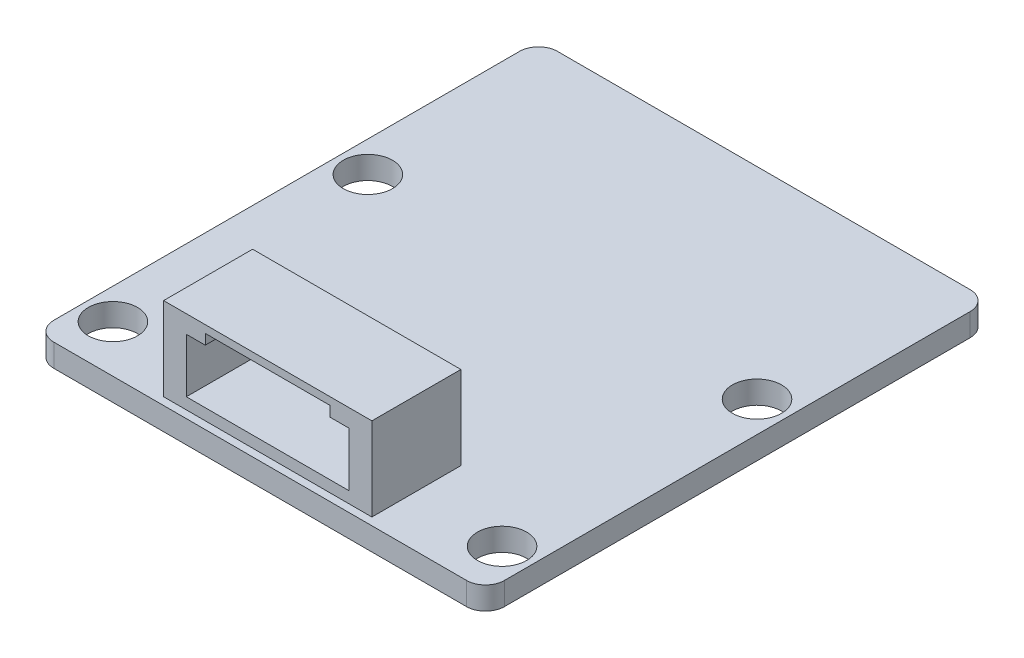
ISO-10303-21;
HEADER;
FILE_DESCRIPTION(('STEP AP214'),'2;1');
FILE_NAME('part.step','',(''),(''),'','','');
FILE_SCHEMA(('AUTOMOTIVE_DESIGN { 1 0 10303 214 1 1 1 1 }'));
ENDSEC;
DATA;
#1=APPLICATION_CONTEXT('core data for automotive mechanical design processes');
#2=APPLICATION_PROTOCOL_DEFINITION('international standard','automotive_design',2000,#1);
#3=PRODUCT_CONTEXT('',#1,'mechanical');
#4=PRODUCT('Part','Part','',(#3));
#5=PRODUCT_RELATED_PRODUCT_CATEGORY('part','',(#4));
#6=PRODUCT_DEFINITION_FORMATION('','',#4);
#7=PRODUCT_DEFINITION_CONTEXT('part definition',#1,'design');
#8=PRODUCT_DEFINITION('design','',#6,#7);
#9=PRODUCT_DEFINITION_SHAPE('','',#8);
#10=(LENGTH_UNIT() NAMED_UNIT(*) SI_UNIT(.MILLI.,.METRE.));
#11=(NAMED_UNIT(*) PLANE_ANGLE_UNIT() SI_UNIT($,.RADIAN.));
#12=(NAMED_UNIT(*) SI_UNIT($,.STERADIAN.) SOLID_ANGLE_UNIT());
#13=UNCERTAINTY_MEASURE_WITH_UNIT(LENGTH_MEASURE(1.E-05),#10,'distance_accuracy_value','');
#14=(GEOMETRIC_REPRESENTATION_CONTEXT(3) GLOBAL_UNCERTAINTY_ASSIGNED_CONTEXT((#13)) GLOBAL_UNIT_ASSIGNED_CONTEXT((#10,
#11,#12)) REPRESENTATION_CONTEXT('',''));
#15=CARTESIAN_POINT('',(0.,0.,0.));
#16=DIRECTION('',(0.,0.,1.));
#17=DIRECTION('',(1.,0.,0.));
#18=AXIS2_PLACEMENT_3D('',#15,#16,#17);
#19=CARTESIAN_POINT('',(0.,7.112,16.383));
#20=DIRECTION('',(0.,0.,-1.));
#21=DIRECTION('',(-1.,0.,0.));
#22=AXIS2_PLACEMENT_3D('',#19,#20,#21);
#23=PLANE('',#22);
#24=DIRECTION('',(1.,0.,0.));
#25=VECTOR('',#24,1.);
#26=CARTESIAN_POINT('',(0.,1.524,16.383));
#27=LINE('',#26,#25);
#28=CARTESIAN_POINT('',(-6.985,1.524,16.383));
#29=VERTEX_POINT('',#28);
#30=CARTESIAN_POINT('',(6.98500000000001,1.524,16.383));
#31=VERTEX_POINT('',#30);
#32=EDGE_CURVE('E267',#29,#31,#27,.T.);
#33=ORIENTED_EDGE('',*,*,#32,.T.);
#34=DIRECTION('',(0.,-1.,0.));
#35=VECTOR('',#34,1.);
#36=CARTESIAN_POINT('',(6.98500000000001,7.112,16.383));
#37=LINE('',#36,#35);
#38=CARTESIAN_POINT('',(6.98500000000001,7.112,16.383));
#39=VERTEX_POINT('',#38);
#40=EDGE_CURVE('E214',#39,#31,#37,.T.);
#41=ORIENTED_EDGE('',*,*,#40,.F.);
#42=DIRECTION('',(1.,0.,0.));
#43=VECTOR('',#42,1.);
#44=CARTESIAN_POINT('',(0.,7.112,16.383));
#45=LINE('',#44,#43);
#46=CARTESIAN_POINT('',(-6.985,7.112,16.383));
#47=VERTEX_POINT('',#46);
#48=EDGE_CURVE('E269',#47,#39,#45,.T.);
#49=ORIENTED_EDGE('',*,*,#48,.F.);
#50=DIRECTION('',(0.,-1.,0.));
#51=VECTOR('',#50,1.);
#52=CARTESIAN_POINT('',(-6.985,7.112,16.383));
#53=LINE('',#52,#51);
#54=EDGE_CURVE('E271',#47,#29,#53,.T.);
#55=ORIENTED_EDGE('',*,*,#54,.T.);
#56=EDGE_LOOP('',(#33,#41,#49,#55));
#57=FACE_BOUND('',#56,.T.);
#58=DIRECTION('',(-1.,0.,0.));
#59=VECTOR('',#58,1.);
#60=CARTESIAN_POINT('',(-4.191,6.604,16.383));
#61=LINE('',#60,#59);
#62=CARTESIAN_POINT('',(4.19100000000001,6.604,16.383));
#63=VERTEX_POINT('',#62);
#64=CARTESIAN_POINT('',(-4.191,6.604,16.383));
#65=VERTEX_POINT('',#64);
#66=EDGE_CURVE('E232',#63,#65,#61,.T.);
#67=ORIENTED_EDGE('',*,*,#66,.F.);
#68=DIRECTION('',(0.,-1.,0.));
#69=VECTOR('',#68,1.);
#70=CARTESIAN_POINT('',(4.19100000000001,5.9182,16.383));
#71=LINE('',#70,#69);
#72=CARTESIAN_POINT('',(4.19100000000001,5.9182,16.383));
#73=VERTEX_POINT('',#72);
#74=EDGE_CURVE('E192',#63,#73,#71,.T.);
#75=ORIENTED_EDGE('',*,*,#74,.T.);
#76=DIRECTION('',(1.,0.,0.));
#77=VECTOR('',#76,1.);
#78=CARTESIAN_POINT('',(4.19100000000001,5.9182,16.383));
#79=LINE('',#78,#77);
#80=CARTESIAN_POINT('',(5.46100000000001,5.9182,16.383));
#81=VERTEX_POINT('',#80);
#82=EDGE_CURVE('E593',#73,#81,#79,.T.);
#83=ORIENTED_EDGE('',*,*,#82,.T.);
#84=DIRECTION('',(0.,-1.,0.));
#85=VECTOR('',#84,1.);
#86=CARTESIAN_POINT('',(5.46100000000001,5.9182,16.383));
#87=LINE('',#86,#85);
#88=CARTESIAN_POINT('',(5.46100000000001,2.286,16.383));
#89=VERTEX_POINT('',#88);
#90=EDGE_CURVE('E596',#81,#89,#87,.T.);
#91=ORIENTED_EDGE('',*,*,#90,.T.);
#92=DIRECTION('',(1.,0.,0.));
#93=VECTOR('',#92,1.);
#94=CARTESIAN_POINT('',(0.,2.286,16.383));
#95=LINE('',#94,#93);
#96=CARTESIAN_POINT('',(-5.461,2.286,16.383));
#97=VERTEX_POINT('',#96);
#98=EDGE_CURVE('E196',#97,#89,#95,.T.);
#99=ORIENTED_EDGE('',*,*,#98,.F.);
#100=DIRECTION('',(0.,-1.,0.));
#101=VECTOR('',#100,1.);
#102=CARTESIAN_POINT('',(-5.461,5.9182,16.383));
#103=LINE('',#102,#101);
#104=CARTESIAN_POINT('',(-5.461,5.9182,16.383));
#105=VERTEX_POINT('',#104);
#106=EDGE_CURVE('E252',#105,#97,#103,.T.);
#107=ORIENTED_EDGE('',*,*,#106,.F.);
#108=DIRECTION('',(-1.,0.,0.));
#109=VECTOR('',#108,1.);
#110=CARTESIAN_POINT('',(-4.191,5.9182,16.383));
#111=LINE('',#110,#109);
#112=CARTESIAN_POINT('',(-4.191,5.9182,16.383));
#113=VERTEX_POINT('',#112);
#114=EDGE_CURVE('E249',#113,#105,#111,.T.);
#115=ORIENTED_EDGE('',*,*,#114,.F.);
#116=DIRECTION('',(0.,-1.,0.));
#117=VECTOR('',#116,1.);
#118=CARTESIAN_POINT('',(-4.191,5.9182,16.383));
#119=LINE('',#118,#117);
#120=EDGE_CURVE('E246',#65,#113,#119,.T.);
#121=ORIENTED_EDGE('',*,*,#120,.F.);
#122=EDGE_LOOP('',(#67,#75,#83,#91,#99,#107,#115,#121));
#123=FACE_BOUND('',#122,.T.);
#124=ADVANCED_FACE('F32',(#57,#123),#23,.F.);
#125=CARTESIAN_POINT('',(-15.113,1.524,-16.891));
#126=DIRECTION('',(0.,0.,1.));
#127=DIRECTION('',(1.,0.,0.));
#128=AXIS2_PLACEMENT_3D('',#125,#126,#127);
#129=PLANE('',#128);
#130=DIRECTION('',(-1.,0.,0.));
#131=VECTOR('',#130,1.);
#132=CARTESIAN_POINT('',(-15.113,1.524,-16.891));
#133=LINE('',#132,#131);
#134=CARTESIAN_POINT('',(13.843,1.524,-16.891));
#135=VERTEX_POINT('',#134);
#136=CARTESIAN_POINT('',(-13.843,1.524,-16.891));
#137=VERTEX_POINT('',#136);
#138=EDGE_CURVE('E296',#135,#137,#133,.T.);
#139=ORIENTED_EDGE('',*,*,#138,.F.);
#140=DIRECTION('',(0.,-1.,0.));
#141=VECTOR('',#140,1.);
#142=CARTESIAN_POINT('',(13.843,0.,-16.891));
#143=LINE('',#142,#141);
#144=CARTESIAN_POINT('',(13.843,0.,-16.891));
#145=VERTEX_POINT('',#144);
#146=EDGE_CURVE('E329',#135,#145,#143,.T.);
#147=ORIENTED_EDGE('',*,*,#146,.T.);
#148=DIRECTION('',(-1.,0.,0.));
#149=VECTOR('',#148,1.);
#150=CARTESIAN_POINT('',(-15.113,0.,-16.891));
#151=LINE('',#150,#149);
#152=CARTESIAN_POINT('',(-13.843,0.,-16.891));
#153=VERTEX_POINT('',#152);
#154=EDGE_CURVE('E287',#145,#153,#151,.T.);
#155=ORIENTED_EDGE('',*,*,#154,.T.);
#156=DIRECTION('',(0.,-1.,0.));
#157=VECTOR('',#156,1.);
#158=CARTESIAN_POINT('',(-13.843,1.524,-16.891));
#159=LINE('',#158,#157);
#160=EDGE_CURVE('E319',#153,#137,#159,.F.);
#161=ORIENTED_EDGE('',*,*,#160,.T.);
#162=EDGE_LOOP('',(#139,#147,#155,#161));
#163=FACE_BOUND('',#162,.T.);
#164=ADVANCED_FACE('F349',(#163),#129,.F.);
#165=CARTESIAN_POINT('',(-15.113,1.524,-16.891));
#166=DIRECTION('',(1.,0.,0.));
#167=DIRECTION('',(0.,0.,-1.));
#168=AXIS2_PLACEMENT_3D('',#165,#166,#167);
#169=PLANE('',#168);
#170=DIRECTION('',(0.,0.,1.));
#171=VECTOR('',#170,1.);
#172=CARTESIAN_POINT('',(-15.113,1.524,-16.891));
#173=LINE('',#172,#171);
#174=CARTESIAN_POINT('',(-15.113,1.524,-15.621));
#175=VERTEX_POINT('',#174);
#176=CARTESIAN_POINT('',(-15.113,1.524,15.621));
#177=VERTEX_POINT('',#176);
#178=EDGE_CURVE('E298',#175,#177,#173,.T.);
#179=ORIENTED_EDGE('',*,*,#178,.F.);
#180=DIRECTION('',(0.,-1.,0.));
#181=VECTOR('',#180,1.);
#182=CARTESIAN_POINT('',(-15.113,1.524,-15.621));
#183=LINE('',#182,#181);
#184=CARTESIAN_POINT('',(-15.113,0.,-15.621));
#185=VERTEX_POINT('',#184);
#186=EDGE_CURVE('E311',#175,#185,#183,.T.);
#187=ORIENTED_EDGE('',*,*,#186,.T.);
#188=DIRECTION('',(0.,0.,1.));
#189=VECTOR('',#188,1.);
#190=CARTESIAN_POINT('',(-15.113,0.,-16.891));
#191=LINE('',#190,#189);
#192=CARTESIAN_POINT('',(-15.113,0.,15.621));
#193=VERTEX_POINT('',#192);
#194=EDGE_CURVE('E306',#185,#193,#191,.T.);
#195=ORIENTED_EDGE('',*,*,#194,.T.);
#196=DIRECTION('',(0.,-1.,0.));
#197=VECTOR('',#196,1.);
#198=CARTESIAN_POINT('',(-15.113,1.524,15.621));
#199=LINE('',#198,#197);
#200=EDGE_CURVE('E304',#193,#177,#199,.F.);
#201=ORIENTED_EDGE('',*,*,#200,.T.);
#202=EDGE_LOOP('',(#179,#187,#195,#201));
#203=FACE_BOUND('',#202,.T.);
#204=ADVANCED_FACE('F371',(#203),#169,.F.);
#205=CARTESIAN_POINT('',(-15.113,1.524,16.891));
#206=DIRECTION('',(0.,0.,-1.));
#207=DIRECTION('',(-1.,0.,0.));
#208=AXIS2_PLACEMENT_3D('',#205,#206,#207);
#209=PLANE('',#208);
#210=DIRECTION('',(1.,0.,0.));
#211=VECTOR('',#210,1.);
#212=CARTESIAN_POINT('',(-15.113,0.,16.891));
#213=LINE('',#212,#211);
#214=CARTESIAN_POINT('',(-13.843,0.,16.891));
#215=VERTEX_POINT('',#214);
#216=CARTESIAN_POINT('',(13.843,0.,16.891));
#217=VERTEX_POINT('',#216);
#218=EDGE_CURVE('E299',#215,#217,#213,.T.);
#219=ORIENTED_EDGE('',*,*,#218,.T.);
#220=DIRECTION('',(0.,-1.,0.));
#221=VECTOR('',#220,1.);
#222=CARTESIAN_POINT('',(13.843,1.524,16.891));
#223=LINE('',#222,#221);
#224=CARTESIAN_POINT('',(13.843,1.524,16.891));
#225=VERTEX_POINT('',#224);
#226=EDGE_CURVE('E11',#217,#225,#223,.F.);
#227=ORIENTED_EDGE('',*,*,#226,.T.);
#228=DIRECTION('',(1.,0.,0.));
#229=VECTOR('',#228,1.);
#230=CARTESIAN_POINT('',(-15.113,1.524,16.891));
#231=LINE('',#230,#229);
#232=CARTESIAN_POINT('',(-13.843,1.524,16.891));
#233=VERTEX_POINT('',#232);
#234=EDGE_CURVE('E302',#233,#225,#231,.T.);
#235=ORIENTED_EDGE('',*,*,#234,.F.);
#236=DIRECTION('',(0.,-1.,0.));
#237=VECTOR('',#236,1.);
#238=CARTESIAN_POINT('',(-13.843,1.524,16.891));
#239=LINE('',#238,#237);
#240=EDGE_CURVE('E326',#233,#215,#239,.T.);
#241=ORIENTED_EDGE('',*,*,#240,.T.);
#242=EDGE_LOOP('',(#219,#227,#235,#241));
#243=FACE_BOUND('',#242,.T.);
#244=ADVANCED_FACE('F362',(#243),#209,.F.);
#245=CARTESIAN_POINT('',(0.,1.524,0.));
#246=DIRECTION('',(0.,1.,0.));
#247=DIRECTION('',(0.,0.,1.));
#248=AXIS2_PLACEMENT_3D('',#245,#246,#247);
#249=PLANE('',#248);
#250=DIRECTION('',(0.,0.,1.));
#251=VECTOR('',#250,1.);
#252=CARTESIAN_POINT('',(6.985,1.524,10.414));
#253=LINE('',#252,#251);
#254=CARTESIAN_POINT('',(6.985,1.524,10.414));
#255=VERTEX_POINT('',#254);
#256=EDGE_CURVE('E208',#255,#31,#253,.T.);
#257=ORIENTED_EDGE('',*,*,#256,.T.);
#258=ORIENTED_EDGE('',*,*,#32,.F.);
#259=DIRECTION('',(0.,0.,1.));
#260=VECTOR('',#259,1.);
#261=CARTESIAN_POINT('',(-6.985,1.524,10.414));
#262=LINE('',#261,#260);
#263=CARTESIAN_POINT('',(-6.985,1.524,10.414));
#264=VERTEX_POINT('',#263);
#265=EDGE_CURVE('E274',#264,#29,#262,.T.);
#266=ORIENTED_EDGE('',*,*,#265,.F.);
#267=DIRECTION('',(-1.,0.,0.));
#268=VECTOR('',#267,1.);
#269=CARTESIAN_POINT('',(0.,1.524,10.414));
#270=LINE('',#269,#268);
#271=EDGE_CURVE('E258',#255,#264,#270,.T.);
#272=ORIENTED_EDGE('',*,*,#271,.F.);
#273=EDGE_LOOP('',(#257,#258,#266,#272));
#274=FACE_BOUND('',#273,.T.);
#275=CARTESIAN_POINT('',(13.05052,1.524,13.716));
#276=DIRECTION('',(0.,-1.,0.));
#277=DIRECTION('',(0.,0.,1.));
#278=AXIS2_PLACEMENT_3D('',#275,#276,#277);
#279=CIRCLE('',#278,1.651);
#280=CARTESIAN_POINT('',(13.05052,1.524,15.367));
#281=VERTEX_POINT('',#280);
#282=EDGE_CURVE('E222',#281,#281,#279,.T.);
#283=ORIENTED_EDGE('',*,*,#282,.T.);
#284=EDGE_LOOP('',(#283));
#285=FACE_BOUND('',#284,.T.);
#286=CARTESIAN_POINT('',(13.05052,1.524,-3.38328000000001));
#287=DIRECTION('',(0.,-1.,0.));
#288=DIRECTION('',(0.,0.,1.));
#289=AXIS2_PLACEMENT_3D('',#286,#287,#288);
#290=CIRCLE('',#289,1.651);
#291=CARTESIAN_POINT('',(13.05052,1.524,-1.73228000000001));
#292=VERTEX_POINT('',#291);
#293=EDGE_CURVE('E217',#292,#292,#290,.T.);
#294=ORIENTED_EDGE('',*,*,#293,.T.);
#295=EDGE_LOOP('',(#294));
#296=FACE_BOUND('',#295,.T.);
#297=DIRECTION('',(0.,0.,1.));
#298=VECTOR('',#297,1.);
#299=CARTESIAN_POINT('',(15.113,1.524,-16.891));
#300=LINE('',#299,#298);
#301=CARTESIAN_POINT('',(15.113,1.524,-15.621));
#302=VERTEX_POINT('',#301);
#303=CARTESIAN_POINT('',(15.113,1.524,15.621));
#304=VERTEX_POINT('',#303);
#305=EDGE_CURVE('E230',#302,#304,#300,.T.);
#306=ORIENTED_EDGE('',*,*,#305,.F.);
#307=CARTESIAN_POINT('',(13.843,1.524,-15.621));
#308=DIRECTION('',(0.,1.,0.));
#309=DIRECTION('',(0.,0.,1.));
#310=AXIS2_PLACEMENT_3D('',#307,#308,#309);
#311=CIRCLE('',#310,1.27);
#312=EDGE_CURVE('E40',#302,#135,#311,.T.);
#313=ORIENTED_EDGE('',*,*,#312,.T.);
#314=ORIENTED_EDGE('',*,*,#138,.T.);
#315=CARTESIAN_POINT('',(-13.843,1.524,-15.621));
#316=DIRECTION('',(0.,1.,0.));
#317=DIRECTION('',(0.,0.,1.));
#318=AXIS2_PLACEMENT_3D('',#315,#316,#317);
#319=CIRCLE('',#318,1.27);
#320=EDGE_CURVE('E324',#137,#175,#319,.T.);
#321=ORIENTED_EDGE('',*,*,#320,.T.);
#322=ORIENTED_EDGE('',*,*,#178,.T.);
#323=CARTESIAN_POINT('',(-13.843,1.524,15.621));
#324=DIRECTION('',(0.,1.,0.));
#325=DIRECTION('',(0.,0.,1.));
#326=AXIS2_PLACEMENT_3D('',#323,#324,#325);
#327=CIRCLE('',#326,1.27);
#328=EDGE_CURVE('E322',#177,#233,#327,.T.);
#329=ORIENTED_EDGE('',*,*,#328,.T.);
#330=ORIENTED_EDGE('',*,*,#234,.T.);
#331=CARTESIAN_POINT('',(13.843,1.524,15.621));
#332=DIRECTION('',(0.,1.,0.));
#333=DIRECTION('',(0.,0.,1.));
#334=AXIS2_PLACEMENT_3D('',#331,#332,#333);
#335=CIRCLE('',#334,1.27);
#336=EDGE_CURVE('E52',#225,#304,#335,.T.);
#337=ORIENTED_EDGE('',*,*,#336,.T.);
#338=EDGE_LOOP('',(#306,#313,#314,#321,#322,#329,#330,#337));
#339=FACE_BOUND('',#338,.T.);
#340=CARTESIAN_POINT('',(-13.05052,1.524,13.716));
#341=DIRECTION('',(0.,1.,0.));
#342=DIRECTION('',(0.,0.,1.));
#343=AXIS2_PLACEMENT_3D('',#340,#341,#342);
#344=CIRCLE('',#343,1.651);
#345=CARTESIAN_POINT('',(-13.05052,1.524,15.367));
#346=VERTEX_POINT('',#345);
#347=EDGE_CURVE('E288',#346,#346,#344,.T.);
#348=ORIENTED_EDGE('',*,*,#347,.F.);
#349=EDGE_LOOP('',(#348));
#350=FACE_BOUND('',#349,.T.);
#351=CARTESIAN_POINT('',(-13.05052,1.524,-3.38328));
#352=DIRECTION('',(0.,1.,0.));
#353=DIRECTION('',(0.,0.,1.));
#354=AXIS2_PLACEMENT_3D('',#351,#352,#353);
#355=CIRCLE('',#354,1.651);
#356=CARTESIAN_POINT('',(-13.05052,1.524,-1.73228));
#357=VERTEX_POINT('',#356);
#358=EDGE_CURVE('E283',#357,#357,#355,.T.);
#359=ORIENTED_EDGE('',*,*,#358,.F.);
#360=EDGE_LOOP('',(#359));
#361=FACE_BOUND('',#360,.T.);
#362=ADVANCED_FACE('F343',(#274,#285,#296,#339,#350,#361),#249,.T.);
#363=CARTESIAN_POINT('',(0.,0.,0.));
#364=DIRECTION('',(0.,1.,0.));
#365=DIRECTION('',(0.,0.,1.));
#366=AXIS2_PLACEMENT_3D('',#363,#364,#365);
#367=PLANE('',#366);
#368=CARTESIAN_POINT('',(13.05052,0.,13.716));
#369=DIRECTION('',(0.,-1.,0.));
#370=DIRECTION('',(0.,0.,1.));
#371=AXIS2_PLACEMENT_3D('',#368,#369,#370);
#372=CIRCLE('',#371,1.651);
#373=CARTESIAN_POINT('',(13.05052,0.,15.367));
#374=VERTEX_POINT('',#373);
#375=EDGE_CURVE('E218',#374,#374,#372,.T.);
#376=ORIENTED_EDGE('',*,*,#375,.F.);
#377=EDGE_LOOP('',(#376));
#378=FACE_BOUND('',#377,.T.);
#379=CARTESIAN_POINT('',(13.05052,0.,-3.38328000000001));
#380=DIRECTION('',(0.,-1.,0.));
#381=DIRECTION('',(0.,0.,1.));
#382=AXIS2_PLACEMENT_3D('',#379,#380,#381);
#383=CIRCLE('',#382,1.651);
#384=CARTESIAN_POINT('',(13.05052,0.,-1.73228000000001));
#385=VERTEX_POINT('',#384);
#386=EDGE_CURVE('E225',#385,#385,#383,.T.);
#387=ORIENTED_EDGE('',*,*,#386,.F.);
#388=EDGE_LOOP('',(#387));
#389=FACE_BOUND('',#388,.T.);
#390=CARTESIAN_POINT('',(-13.05052,0.,13.716));
#391=DIRECTION('',(0.,1.,0.));
#392=DIRECTION('',(0.,0.,1.));
#393=AXIS2_PLACEMENT_3D('',#390,#391,#392);
#394=CIRCLE('',#393,1.651);
#395=CARTESIAN_POINT('',(-13.05052,0.,15.367));
#396=VERTEX_POINT('',#395);
#397=EDGE_CURVE('E284',#396,#396,#394,.T.);
#398=ORIENTED_EDGE('',*,*,#397,.T.);
#399=EDGE_LOOP('',(#398));
#400=FACE_BOUND('',#399,.T.);
#401=CARTESIAN_POINT('',(-13.05052,0.,-3.38328));
#402=DIRECTION('',(0.,1.,0.));
#403=DIRECTION('',(0.,0.,1.));
#404=AXIS2_PLACEMENT_3D('',#401,#402,#403);
#405=CIRCLE('',#404,1.651);
#406=CARTESIAN_POINT('',(-13.05052,0.,-1.73228));
#407=VERTEX_POINT('',#406);
#408=EDGE_CURVE('E291',#407,#407,#405,.T.);
#409=ORIENTED_EDGE('',*,*,#408,.T.);
#410=EDGE_LOOP('',(#409));
#411=FACE_BOUND('',#410,.T.);
#412=ORIENTED_EDGE('',*,*,#154,.F.);
#413=CARTESIAN_POINT('',(13.843,0.,-15.621));
#414=DIRECTION('',(0.,1.,0.));
#415=DIRECTION('',(0.,0.,1.));
#416=AXIS2_PLACEMENT_3D('',#413,#414,#415);
#417=CIRCLE('',#416,1.27);
#418=CARTESIAN_POINT('',(15.113,0.,-15.621));
#419=VERTEX_POINT('',#418);
#420=EDGE_CURVE('E334',#145,#419,#417,.F.);
#421=ORIENTED_EDGE('',*,*,#420,.T.);
#422=DIRECTION('',(0.,0.,1.));
#423=VECTOR('',#422,1.);
#424=CARTESIAN_POINT('',(15.113,0.,-16.891));
#425=LINE('',#424,#423);
#426=CARTESIAN_POINT('',(15.113,0.,15.621));
#427=VERTEX_POINT('',#426);
#428=EDGE_CURVE('E221',#419,#427,#425,.T.);
#429=ORIENTED_EDGE('',*,*,#428,.T.);
#430=CARTESIAN_POINT('',(13.843,0.,15.621));
#431=DIRECTION('',(0.,1.,0.));
#432=DIRECTION('',(0.,0.,1.));
#433=AXIS2_PLACEMENT_3D('',#430,#431,#432);
#434=CIRCLE('',#433,1.27);
#435=EDGE_CURVE('E332',#427,#217,#434,.F.);
#436=ORIENTED_EDGE('',*,*,#435,.T.);
#437=ORIENTED_EDGE('',*,*,#218,.F.);
#438=CARTESIAN_POINT('',(-13.843,0.,15.621));
#439=DIRECTION('',(0.,1.,0.));
#440=DIRECTION('',(0.,0.,1.));
#441=AXIS2_PLACEMENT_3D('',#438,#439,#440);
#442=CIRCLE('',#441,1.27);
#443=EDGE_CURVE('E314',#215,#193,#442,.F.);
#444=ORIENTED_EDGE('',*,*,#443,.T.);
#445=ORIENTED_EDGE('',*,*,#194,.F.);
#446=CARTESIAN_POINT('',(-13.843,0.,-15.621));
#447=DIRECTION('',(0.,1.,0.));
#448=DIRECTION('',(0.,0.,1.));
#449=AXIS2_PLACEMENT_3D('',#446,#447,#448);
#450=CIRCLE('',#449,1.27);
#451=EDGE_CURVE('E316',#185,#153,#450,.F.);
#452=ORIENTED_EDGE('',*,*,#451,.T.);
#453=EDGE_LOOP('',(#412,#421,#429,#436,#437,#444,#445,#452));
#454=FACE_BOUND('',#453,.T.);
#455=ADVANCED_FACE('F356',(#378,#389,#400,#411,#454),#367,.F.);
#456=CARTESIAN_POINT('',(-13.843,1.524,-15.621));
#457=DIRECTION('',(0.,-1.,0.));
#458=DIRECTION('',(0.,0.,-1.));
#459=AXIS2_PLACEMENT_3D('',#456,#457,#458);
#460=CYLINDRICAL_SURFACE('',#459,1.27);
#461=ORIENTED_EDGE('',*,*,#320,.F.);
#462=ORIENTED_EDGE('',*,*,#160,.F.);
#463=ORIENTED_EDGE('',*,*,#451,.F.);
#464=ORIENTED_EDGE('',*,*,#186,.F.);
#465=EDGE_LOOP('',(#461,#462,#463,#464));
#466=FACE_BOUND('',#465,.T.);
#467=ADVANCED_FACE('F374',(#466),#460,.T.);
#468=CARTESIAN_POINT('',(-13.843,1.524,15.621));
#469=DIRECTION('',(0.,-1.,0.));
#470=DIRECTION('',(0.,0.,-1.));
#471=AXIS2_PLACEMENT_3D('',#468,#469,#470);
#472=CYLINDRICAL_SURFACE('',#471,1.27);
#473=ORIENTED_EDGE('',*,*,#328,.F.);
#474=ORIENTED_EDGE('',*,*,#200,.F.);
#475=ORIENTED_EDGE('',*,*,#443,.F.);
#476=ORIENTED_EDGE('',*,*,#240,.F.);
#477=EDGE_LOOP('',(#473,#474,#475,#476));
#478=FACE_BOUND('',#477,.T.);
#479=ADVANCED_FACE('F366',(#478),#472,.T.);
#480=CARTESIAN_POINT('',(-13.05052,0.,-3.38328));
#481=DIRECTION('',(0.,1.,0.));
#482=DIRECTION('',(0.,0.,1.));
#483=AXIS2_PLACEMENT_3D('',#480,#481,#482);
#484=CYLINDRICAL_SURFACE('',#483,1.651);
#485=CARTESIAN_POINT('',(-13.05052,0.,-1.73228));
#486=CARTESIAN_POINT('',(-13.05052,0.015875,-1.73228));
#487=CARTESIAN_POINT('',(-13.05052,0.03175,-1.73228));
#488=CARTESIAN_POINT('',(-13.05052,0.0635,-1.73228));
#489=CARTESIAN_POINT('',(-13.05052,0.079375,-1.73228));
#490=CARTESIAN_POINT('',(-13.05052,0.111125,-1.73228));
#491=CARTESIAN_POINT('',(-13.05052,0.127,-1.73228));
#492=CARTESIAN_POINT('',(-13.05052,0.15875,-1.73228));
#493=CARTESIAN_POINT('',(-13.05052,0.174625,-1.73228));
#494=CARTESIAN_POINT('',(-13.05052,0.206375,-1.73228));
#495=CARTESIAN_POINT('',(-13.05052,0.22225,-1.73228));
#496=CARTESIAN_POINT('',(-13.05052,0.254,-1.73228));
#497=CARTESIAN_POINT('',(-13.05052,0.269875,-1.73228));
#498=CARTESIAN_POINT('',(-13.05052,0.301625,-1.73228));
#499=CARTESIAN_POINT('',(-13.05052,0.3175,-1.73228));
#500=CARTESIAN_POINT('',(-13.05052,0.34925,-1.73228));
#501=CARTESIAN_POINT('',(-13.05052,0.365125,-1.73228));
#502=CARTESIAN_POINT('',(-13.05052,0.396875,-1.73228));
#503=CARTESIAN_POINT('',(-13.05052,0.41275,-1.73228));
#504=CARTESIAN_POINT('',(-13.05052,0.4445,-1.73228));
#505=CARTESIAN_POINT('',(-13.05052,0.460375,-1.73228));
#506=CARTESIAN_POINT('',(-13.05052,0.492125,-1.73228));
#507=CARTESIAN_POINT('',(-13.05052,0.508,-1.73228));
#508=CARTESIAN_POINT('',(-13.05052,0.53975,-1.73228));
#509=CARTESIAN_POINT('',(-13.05052,0.555625,-1.73228));
#510=CARTESIAN_POINT('',(-13.05052,0.587375,-1.73228));
#511=CARTESIAN_POINT('',(-13.05052,0.60325,-1.73228));
#512=CARTESIAN_POINT('',(-13.05052,0.635,-1.73228));
#513=CARTESIAN_POINT('',(-13.05052,0.650875,-1.73228));
#514=CARTESIAN_POINT('',(-13.05052,0.682625,-1.73228));
#515=CARTESIAN_POINT('',(-13.05052,0.6985,-1.73228));
#516=CARTESIAN_POINT('',(-13.05052,0.73025,-1.73228));
#517=CARTESIAN_POINT('',(-13.05052,0.746125,-1.73228));
#518=CARTESIAN_POINT('',(-13.05052,0.777875,-1.73228));
#519=CARTESIAN_POINT('',(-13.05052,0.79375,-1.73228));
#520=CARTESIAN_POINT('',(-13.05052,0.8255,-1.73228));
#521=CARTESIAN_POINT('',(-13.05052,0.841375,-1.73228));
#522=CARTESIAN_POINT('',(-13.05052,0.873125,-1.73228));
#523=CARTESIAN_POINT('',(-13.05052,0.889,-1.73228));
#524=CARTESIAN_POINT('',(-13.05052,0.92075,-1.73228));
#525=CARTESIAN_POINT('',(-13.05052,0.936625,-1.73228));
#526=CARTESIAN_POINT('',(-13.05052,0.968375,-1.73228));
#527=CARTESIAN_POINT('',(-13.05052,0.98425,-1.73228));
#528=CARTESIAN_POINT('',(-13.05052,1.016,-1.73228));
#529=CARTESIAN_POINT('',(-13.05052,1.031875,-1.73228));
#530=CARTESIAN_POINT('',(-13.05052,1.063625,-1.73228));
#531=CARTESIAN_POINT('',(-13.05052,1.0795,-1.73228));
#532=CARTESIAN_POINT('',(-13.05052,1.11125,-1.73228));
#533=CARTESIAN_POINT('',(-13.05052,1.127125,-1.73228));
#534=CARTESIAN_POINT('',(-13.05052,1.158875,-1.73228));
#535=CARTESIAN_POINT('',(-13.05052,1.17475,-1.73228));
#536=CARTESIAN_POINT('',(-13.05052,1.2065,-1.73228));
#537=CARTESIAN_POINT('',(-13.05052,1.222375,-1.73228));
#538=CARTESIAN_POINT('',(-13.05052,1.254125,-1.73228));
#539=CARTESIAN_POINT('',(-13.05052,1.27,-1.73228));
#540=CARTESIAN_POINT('',(-13.05052,1.30175,-1.73228));
#541=CARTESIAN_POINT('',(-13.05052,1.317625,-1.73228));
#542=CARTESIAN_POINT('',(-13.05052,1.349375,-1.73228));
#543=CARTESIAN_POINT('',(-13.05052,1.36525,-1.73228));
#544=CARTESIAN_POINT('',(-13.05052,1.397,-1.73228));
#545=CARTESIAN_POINT('',(-13.05052,1.412875,-1.73228));
#546=CARTESIAN_POINT('',(-13.05052,1.444625,-1.73228));
#547=CARTESIAN_POINT('',(-13.05052,1.4605,-1.73228));
#548=CARTESIAN_POINT('',(-13.05052,1.49225,-1.73228));
#549=CARTESIAN_POINT('',(-13.05052,1.508125,-1.73228));
#550=CARTESIAN_POINT('',(-13.05052,1.524,-1.73228));
#551=B_SPLINE_CURVE_WITH_KNOTS('',3,(#485,#486,#487,#488,#489,#490,#491,#492,#493,#494,#495,
#496,#497,#498,#499,#500,#501,#502,#503,#504,#505,#506,#507,#508,#509,#510,#511,#512,#513,#514,
#515,#516,#517,#518,#519,#520,#521,#522,#523,#524,#525,#526,#527,#528,#529,#530,#531,#532,#533,
#534,#535,#536,#537,#538,#539,#540,#541,#542,#543,#544,#545,#546,#547,#548,#549,#550),
.UNSPECIFIED.,.F.,.F.,(4,2,2,2,2,2,2,2,2,2,2,2,2,2,2,2,2,2,2,2,2,2,2,2,2,2,2,2,2,2,2,2,4),(0.,
0.047625,0.09525,0.142875,0.1905,0.238125,0.28575,0.333375,0.381,0.428625,0.47625,0.523875,
0.5715,0.619125,0.66675,0.714375,0.762,0.809625,0.85725,0.904875,0.9525,1.000125,1.04775,
1.095375,1.143,1.190625,1.23825,1.285875,1.3335,1.381125,1.42875,1.476375,1.524),.UNSPECIFIED.);
#552=EDGE_CURVE('BSEAM381',#407,#357,#551,.T.);
#553=ORIENTED_EDGE('',*,*,#408,.F.);
#554=ORIENTED_EDGE('',*,*,#358,.T.);
#555=ORIENTED_EDGE('',*,*,#552,.T.);
#556=ORIENTED_EDGE('',*,*,#552,.F.);
#557=EDGE_LOOP('',(#553,#555,#554,#556));
#558=FACE_BOUND('',#557,.T.);
#559=ADVANCED_FACE('F381',(#558),#484,.F.);
#560=CARTESIAN_POINT('',(-13.05052,0.,13.716));
#561=DIRECTION('',(0.,1.,0.));
#562=DIRECTION('',(0.,0.,1.));
#563=AXIS2_PLACEMENT_3D('',#560,#561,#562);
#564=CYLINDRICAL_SURFACE('',#563,1.651);
#565=CARTESIAN_POINT('',(-13.05052,0.,15.367));
#566=CARTESIAN_POINT('',(-13.05052,0.015875,15.367));
#567=CARTESIAN_POINT('',(-13.05052,0.03175,15.367));
#568=CARTESIAN_POINT('',(-13.05052,0.0635,15.367));
#569=CARTESIAN_POINT('',(-13.05052,0.079375,15.367));
#570=CARTESIAN_POINT('',(-13.05052,0.111125,15.367));
#571=CARTESIAN_POINT('',(-13.05052,0.127,15.367));
#572=CARTESIAN_POINT('',(-13.05052,0.15875,15.367));
#573=CARTESIAN_POINT('',(-13.05052,0.174625,15.367));
#574=CARTESIAN_POINT('',(-13.05052,0.206375,15.367));
#575=CARTESIAN_POINT('',(-13.05052,0.22225,15.367));
#576=CARTESIAN_POINT('',(-13.05052,0.254,15.367));
#577=CARTESIAN_POINT('',(-13.05052,0.269875,15.367));
#578=CARTESIAN_POINT('',(-13.05052,0.301625,15.367));
#579=CARTESIAN_POINT('',(-13.05052,0.3175,15.367));
#580=CARTESIAN_POINT('',(-13.05052,0.34925,15.367));
#581=CARTESIAN_POINT('',(-13.05052,0.365125,15.367));
#582=CARTESIAN_POINT('',(-13.05052,0.396875,15.367));
#583=CARTESIAN_POINT('',(-13.05052,0.41275,15.367));
#584=CARTESIAN_POINT('',(-13.05052,0.4445,15.367));
#585=CARTESIAN_POINT('',(-13.05052,0.460375,15.367));
#586=CARTESIAN_POINT('',(-13.05052,0.492125,15.367));
#587=CARTESIAN_POINT('',(-13.05052,0.508,15.367));
#588=CARTESIAN_POINT('',(-13.05052,0.53975,15.367));
#589=CARTESIAN_POINT('',(-13.05052,0.555625,15.367));
#590=CARTESIAN_POINT('',(-13.05052,0.587375,15.367));
#591=CARTESIAN_POINT('',(-13.05052,0.60325,15.367));
#592=CARTESIAN_POINT('',(-13.05052,0.635,15.367));
#593=CARTESIAN_POINT('',(-13.05052,0.650875,15.367));
#594=CARTESIAN_POINT('',(-13.05052,0.682625,15.367));
#595=CARTESIAN_POINT('',(-13.05052,0.6985,15.367));
#596=CARTESIAN_POINT('',(-13.05052,0.73025,15.367));
#597=CARTESIAN_POINT('',(-13.05052,0.746125,15.367));
#598=CARTESIAN_POINT('',(-13.05052,0.777875,15.367));
#599=CARTESIAN_POINT('',(-13.05052,0.79375,15.367));
#600=CARTESIAN_POINT('',(-13.05052,0.8255,15.367));
#601=CARTESIAN_POINT('',(-13.05052,0.841375,15.367));
#602=CARTESIAN_POINT('',(-13.05052,0.873125,15.367));
#603=CARTESIAN_POINT('',(-13.05052,0.889,15.367));
#604=CARTESIAN_POINT('',(-13.05052,0.92075,15.367));
#605=CARTESIAN_POINT('',(-13.05052,0.936625,15.367));
#606=CARTESIAN_POINT('',(-13.05052,0.968375,15.367));
#607=CARTESIAN_POINT('',(-13.05052,0.98425,15.367));
#608=CARTESIAN_POINT('',(-13.05052,1.016,15.367));
#609=CARTESIAN_POINT('',(-13.05052,1.031875,15.367));
#610=CARTESIAN_POINT('',(-13.05052,1.063625,15.367));
#611=CARTESIAN_POINT('',(-13.05052,1.0795,15.367));
#612=CARTESIAN_POINT('',(-13.05052,1.11125,15.367));
#613=CARTESIAN_POINT('',(-13.05052,1.127125,15.367));
#614=CARTESIAN_POINT('',(-13.05052,1.158875,15.367));
#615=CARTESIAN_POINT('',(-13.05052,1.17475,15.367));
#616=CARTESIAN_POINT('',(-13.05052,1.2065,15.367));
#617=CARTESIAN_POINT('',(-13.05052,1.222375,15.367));
#618=CARTESIAN_POINT('',(-13.05052,1.254125,15.367));
#619=CARTESIAN_POINT('',(-13.05052,1.27,15.367));
#620=CARTESIAN_POINT('',(-13.05052,1.30175,15.367));
#621=CARTESIAN_POINT('',(-13.05052,1.317625,15.367));
#622=CARTESIAN_POINT('',(-13.05052,1.349375,15.367));
#623=CARTESIAN_POINT('',(-13.05052,1.36525,15.367));
#624=CARTESIAN_POINT('',(-13.05052,1.397,15.367));
#625=CARTESIAN_POINT('',(-13.05052,1.412875,15.367));
#626=CARTESIAN_POINT('',(-13.05052,1.444625,15.367));
#627=CARTESIAN_POINT('',(-13.05052,1.4605,15.367));
#628=CARTESIAN_POINT('',(-13.05052,1.49225,15.367));
#629=CARTESIAN_POINT('',(-13.05052,1.508125,15.367));
#630=CARTESIAN_POINT('',(-13.05052,1.524,15.367));
#631=B_SPLINE_CURVE_WITH_KNOTS('',3,(#565,#566,#567,#568,#569,#570,#571,#572,#573,#574,#575,
#576,#577,#578,#579,#580,#581,#582,#583,#584,#585,#586,#587,#588,#589,#590,#591,#592,#593,#594,
#595,#596,#597,#598,#599,#600,#601,#602,#603,#604,#605,#606,#607,#608,#609,#610,#611,#612,#613,
#614,#615,#616,#617,#618,#619,#620,#621,#622,#623,#624,#625,#626,#627,#628,#629,#630),
.UNSPECIFIED.,.F.,.F.,(4,2,2,2,2,2,2,2,2,2,2,2,2,2,2,2,2,2,2,2,2,2,2,2,2,2,2,2,2,2,2,2,4),(0.,
0.047625,0.09525,0.142875,0.1905,0.238125,0.28575,0.333375,0.381,0.428625,0.47625,0.523875,
0.5715,0.619125,0.66675,0.714375,0.762,0.809625,0.85725,0.904875,0.9525,1.000125,1.04775,
1.095375,1.143,1.190625,1.23825,1.285875,1.3335,1.381125,1.42875,1.476375,1.524),.UNSPECIFIED.);
#632=EDGE_CURVE('BSEAM404',#396,#346,#631,.T.);
#633=ORIENTED_EDGE('',*,*,#397,.F.);
#634=ORIENTED_EDGE('',*,*,#347,.T.);
#635=ORIENTED_EDGE('',*,*,#632,.T.);
#636=ORIENTED_EDGE('',*,*,#632,.F.);
#637=EDGE_LOOP('',(#633,#635,#634,#636));
#638=FACE_BOUND('',#637,.T.);
#639=ADVANCED_FACE('F404',(#638),#564,.F.);
#640=CARTESIAN_POINT('',(0.,7.112,10.414));
#641=DIRECTION('',(0.,0.,1.));
#642=DIRECTION('',(1.,0.,0.));
#643=AXIS2_PLACEMENT_3D('',#640,#641,#642);
#644=PLANE('',#643);
#645=ORIENTED_EDGE('',*,*,#271,.T.);
#646=DIRECTION('',(0.,-1.,0.));
#647=VECTOR('',#646,1.);
#648=CARTESIAN_POINT('',(-6.985,7.112,10.414));
#649=LINE('',#648,#647);
#650=CARTESIAN_POINT('',(-6.985,7.112,10.414));
#651=VERTEX_POINT('',#650);
#652=EDGE_CURVE('E280',#651,#264,#649,.T.);
#653=ORIENTED_EDGE('',*,*,#652,.F.);
#654=DIRECTION('',(-1.,0.,0.));
#655=VECTOR('',#654,1.);
#656=CARTESIAN_POINT('',(0.,7.112,10.414));
#657=LINE('',#656,#655);
#658=CARTESIAN_POINT('',(6.985,7.112,10.414));
#659=VERTEX_POINT('',#658);
#660=EDGE_CURVE('E264',#659,#651,#657,.T.);
#661=ORIENTED_EDGE('',*,*,#660,.F.);
#662=DIRECTION('',(0.,-1.,0.));
#663=VECTOR('',#662,1.);
#664=CARTESIAN_POINT('',(6.985,7.112,10.414));
#665=LINE('',#664,#663);
#666=EDGE_CURVE('E207',#659,#255,#665,.T.);
#667=ORIENTED_EDGE('',*,*,#666,.T.);
#668=EDGE_LOOP('',(#645,#653,#661,#667));
#669=FACE_BOUND('',#668,.T.);
#670=ADVANCED_FACE('F400',(#669),#644,.F.);
#671=CARTESIAN_POINT('',(-6.985,7.112,10.414));
#672=DIRECTION('',(1.,0.,0.));
#673=DIRECTION('',(0.,0.,-1.));
#674=AXIS2_PLACEMENT_3D('',#671,#672,#673);
#675=PLANE('',#674);
#676=ORIENTED_EDGE('',*,*,#265,.T.);
#677=ORIENTED_EDGE('',*,*,#54,.F.);
#678=DIRECTION('',(0.,0.,1.));
#679=VECTOR('',#678,1.);
#680=CARTESIAN_POINT('',(-6.985,7.112,10.414));
#681=LINE('',#680,#679);
#682=EDGE_CURVE('E266',#651,#47,#681,.T.);
#683=ORIENTED_EDGE('',*,*,#682,.F.);
#684=ORIENTED_EDGE('',*,*,#652,.T.);
#685=EDGE_LOOP('',(#676,#677,#683,#684));
#686=FACE_BOUND('',#685,.T.);
#687=ADVANCED_FACE('F397',(#686),#675,.F.);
#688=CARTESIAN_POINT('',(0.,7.112,0.));
#689=DIRECTION('',(0.,-1.,0.));
#690=DIRECTION('',(0.,0.,-1.));
#691=AXIS2_PLACEMENT_3D('',#688,#689,#690);
#692=PLANE('',#691);
#693=ORIENTED_EDGE('',*,*,#48,.T.);
#694=DIRECTION('',(0.,0.,1.));
#695=VECTOR('',#694,1.);
#696=CARTESIAN_POINT('',(6.985,7.112,10.414));
#697=LINE('',#696,#695);
#698=EDGE_CURVE('E204',#659,#39,#697,.T.);
#699=ORIENTED_EDGE('',*,*,#698,.F.);
#700=ORIENTED_EDGE('',*,*,#660,.T.);
#701=ORIENTED_EDGE('',*,*,#682,.T.);
#702=EDGE_LOOP('',(#693,#699,#700,#701));
#703=FACE_BOUND('',#702,.T.);
#704=ADVANCED_FACE('F395',(#703),#692,.F.);
#705=CARTESIAN_POINT('',(0.,2.286,11.303));
#706=DIRECTION('',(0.,-1.,0.));
#707=DIRECTION('',(1.,0.,0.));
#708=AXIS2_PLACEMENT_3D('',#705,#706,#707);
#709=PLANE('',#708);
#710=ORIENTED_EDGE('',*,*,#98,.T.);
#711=DIRECTION('',(0.,0.,1.));
#712=VECTOR('',#711,1.);
#713=CARTESIAN_POINT('',(5.461,2.286,11.303));
#714=LINE('',#713,#712);
#715=CARTESIAN_POINT('',(5.461,2.286,11.303));
#716=VERTEX_POINT('',#715);
#717=EDGE_CURVE('E188',#716,#89,#714,.T.);
#718=ORIENTED_EDGE('',*,*,#717,.F.);
#719=DIRECTION('',(1.,0.,0.));
#720=VECTOR('',#719,1.);
#721=CARTESIAN_POINT('',(0.,2.286,11.303));
#722=LINE('',#721,#720);
#723=CARTESIAN_POINT('',(-5.461,2.286,11.303));
#724=VERTEX_POINT('',#723);
#725=EDGE_CURVE('E171',#724,#716,#722,.T.);
#726=ORIENTED_EDGE('',*,*,#725,.F.);
#727=DIRECTION('',(0.,0.,1.));
#728=VECTOR('',#727,1.);
#729=CARTESIAN_POINT('',(-5.461,2.286,11.303));
#730=LINE('',#729,#728);
#731=EDGE_CURVE('E256',#724,#97,#730,.T.);
#732=ORIENTED_EDGE('',*,*,#731,.T.);
#733=EDGE_LOOP('',(#710,#718,#726,#732));
#734=FACE_BOUND('',#733,.T.);
#735=ADVANCED_FACE('F194',(#734),#709,.F.);
#736=CARTESIAN_POINT('',(-5.461,5.9182,11.303));
#737=DIRECTION('',(-1.,0.,0.));
#738=DIRECTION('',(0.,-1.,0.));
#739=AXIS2_PLACEMENT_3D('',#736,#737,#738);
#740=PLANE('',#739);
#741=ORIENTED_EDGE('',*,*,#106,.T.);
#742=ORIENTED_EDGE('',*,*,#731,.F.);
#743=DIRECTION('',(0.,-1.,0.));
#744=VECTOR('',#743,1.);
#745=CARTESIAN_POINT('',(-5.461,5.9182,11.303));
#746=LINE('',#745,#744);
#747=CARTESIAN_POINT('',(-5.461,5.9182,11.303));
#748=VERTEX_POINT('',#747);
#749=EDGE_CURVE('E178',#748,#724,#746,.T.);
#750=ORIENTED_EDGE('',*,*,#749,.F.);
#751=DIRECTION('',(0.,0.,1.));
#752=VECTOR('',#751,1.);
#753=CARTESIAN_POINT('',(-5.461,5.9182,11.303));
#754=LINE('',#753,#752);
#755=EDGE_CURVE('E259',#748,#105,#754,.T.);
#756=ORIENTED_EDGE('',*,*,#755,.T.);
#757=EDGE_LOOP('',(#741,#742,#750,#756));
#758=FACE_BOUND('',#757,.T.);
#759=ADVANCED_FACE('F463',(#758),#740,.F.);
#760=CARTESIAN_POINT('',(-4.191,5.9182,11.303));
#761=DIRECTION('',(0.,1.,0.));
#762=DIRECTION('',(0.,0.,1.));
#763=AXIS2_PLACEMENT_3D('',#760,#761,#762);
#764=PLANE('',#763);
#765=ORIENTED_EDGE('',*,*,#114,.T.);
#766=ORIENTED_EDGE('',*,*,#755,.F.);
#767=DIRECTION('',(-1.,0.,0.));
#768=VECTOR('',#767,1.);
#769=CARTESIAN_POINT('',(-4.191,5.9182,11.303));
#770=LINE('',#769,#768);
#771=CARTESIAN_POINT('',(-4.191,5.9182,11.303));
#772=VERTEX_POINT('',#771);
#773=EDGE_CURVE('E241',#772,#748,#770,.T.);
#774=ORIENTED_EDGE('',*,*,#773,.F.);
#775=DIRECTION('',(0.,0.,1.));
#776=VECTOR('',#775,1.);
#777=CARTESIAN_POINT('',(-4.191,5.9182,11.303));
#778=LINE('',#777,#776);
#779=EDGE_CURVE('E261',#772,#113,#778,.T.);
#780=ORIENTED_EDGE('',*,*,#779,.T.);
#781=EDGE_LOOP('',(#765,#766,#774,#780));
#782=FACE_BOUND('',#781,.T.);
#783=ADVANCED_FACE('F571',(#782),#764,.F.);
#784=CARTESIAN_POINT('',(-4.191,5.9182,11.303));
#785=DIRECTION('',(-1.,0.,0.));
#786=DIRECTION('',(0.,0.,1.));
#787=AXIS2_PLACEMENT_3D('',#784,#785,#786);
#788=PLANE('',#787);
#789=ORIENTED_EDGE('',*,*,#120,.T.);
#790=ORIENTED_EDGE('',*,*,#779,.F.);
#791=DIRECTION('',(0.,-1.,0.));
#792=VECTOR('',#791,1.);
#793=CARTESIAN_POINT('',(-4.191,5.9182,11.303));
#794=LINE('',#793,#792);
#795=CARTESIAN_POINT('',(-4.191,6.604,11.303));
#796=VERTEX_POINT('',#795);
#797=EDGE_CURVE('E238',#796,#772,#794,.T.);
#798=ORIENTED_EDGE('',*,*,#797,.F.);
#799=DIRECTION('',(0.,0.,1.));
#800=VECTOR('',#799,1.);
#801=CARTESIAN_POINT('',(-4.191,6.604,11.303));
#802=LINE('',#801,#800);
#803=EDGE_CURVE('E181',#796,#65,#802,.T.);
#804=ORIENTED_EDGE('',*,*,#803,.T.);
#805=EDGE_LOOP('',(#789,#790,#798,#804));
#806=FACE_BOUND('',#805,.T.);
#807=ADVANCED_FACE('F476',(#806),#788,.F.);
#808=CARTESIAN_POINT('',(-4.191,6.604,11.303));
#809=DIRECTION('',(0.,1.,0.));
#810=DIRECTION('',(0.,0.,1.));
#811=AXIS2_PLACEMENT_3D('',#808,#809,#810);
#812=PLANE('',#811);
#813=ORIENTED_EDGE('',*,*,#66,.T.);
#814=ORIENTED_EDGE('',*,*,#803,.F.);
#815=DIRECTION('',(-1.,0.,0.));
#816=VECTOR('',#815,1.);
#817=CARTESIAN_POINT('',(-4.191,6.604,11.303));
#818=LINE('',#817,#816);
#819=CARTESIAN_POINT('',(4.191,6.604,11.303));
#820=VERTEX_POINT('',#819);
#821=EDGE_CURVE('E235',#820,#796,#818,.T.);
#822=ORIENTED_EDGE('',*,*,#821,.F.);
#823=DIRECTION('',(0.,0.,1.));
#824=VECTOR('',#823,1.);
#825=CARTESIAN_POINT('',(4.191,6.604,11.303));
#826=LINE('',#825,#824);
#827=EDGE_CURVE('E211',#820,#63,#826,.T.);
#828=ORIENTED_EDGE('',*,*,#827,.T.);
#829=EDGE_LOOP('',(#813,#814,#822,#828));
#830=FACE_BOUND('',#829,.T.);
#831=ADVANCED_FACE('F472',(#830),#812,.F.);
#832=CARTESIAN_POINT('',(0.,0.,11.303));
#833=DIRECTION('',(0.,0.,-1.));
#834=DIRECTION('',(-1.,0.,0.));
#835=AXIS2_PLACEMENT_3D('',#832,#833,#834);
#836=PLANE('',#835);
#837=ORIENTED_EDGE('',*,*,#725,.T.);
#838=DIRECTION('',(0.,-1.,0.));
#839=VECTOR('',#838,1.);
#840=CARTESIAN_POINT('',(5.461,5.9182,11.303));
#841=LINE('',#840,#839);
#842=CARTESIAN_POINT('',(5.461,5.9182,11.303));
#843=VERTEX_POINT('',#842);
#844=EDGE_CURVE('E175',#843,#716,#841,.T.);
#845=ORIENTED_EDGE('',*,*,#844,.F.);
#846=DIRECTION('',(1.,0.,0.));
#847=VECTOR('',#846,1.);
#848=CARTESIAN_POINT('',(4.191,5.9182,11.303));
#849=LINE('',#848,#847);
#850=CARTESIAN_POINT('',(4.191,5.9182,11.303));
#851=VERTEX_POINT('',#850);
#852=EDGE_CURVE('E191',#851,#843,#849,.T.);
#853=ORIENTED_EDGE('',*,*,#852,.F.);
#854=DIRECTION('',(0.,-1.,0.));
#855=VECTOR('',#854,1.);
#856=CARTESIAN_POINT('',(4.191,5.9182,11.303));
#857=LINE('',#856,#855);
#858=EDGE_CURVE('E197',#820,#851,#857,.T.);
#859=ORIENTED_EDGE('',*,*,#858,.F.);
#860=ORIENTED_EDGE('',*,*,#821,.T.);
#861=ORIENTED_EDGE('',*,*,#797,.T.);
#862=ORIENTED_EDGE('',*,*,#773,.T.);
#863=ORIENTED_EDGE('',*,*,#749,.T.);
#864=EDGE_LOOP('',(#837,#845,#853,#859,#860,#861,#862,#863));
#865=FACE_BOUND('',#864,.T.);
#866=ADVANCED_FACE('F173',(#865),#836,.F.);
#867=CARTESIAN_POINT('',(15.113,1.524,-16.891));
#868=DIRECTION('',(1.,0.,0.));
#869=DIRECTION('',(0.,0.,-1.));
#870=AXIS2_PLACEMENT_3D('',#867,#868,#869);
#871=PLANE('',#870);
#872=ORIENTED_EDGE('',*,*,#428,.F.);
#873=DIRECTION('',(0.,-1.,0.));
#874=VECTOR('',#873,1.);
#875=CARTESIAN_POINT('',(15.113,1.524,-15.621));
#876=LINE('',#875,#874);
#877=EDGE_CURVE('E339',#419,#302,#876,.F.);
#878=ORIENTED_EDGE('',*,*,#877,.T.);
#879=ORIENTED_EDGE('',*,*,#305,.T.);
#880=DIRECTION('',(0.,-1.,0.));
#881=VECTOR('',#880,1.);
#882=CARTESIAN_POINT('',(15.113,0.,15.621));
#883=LINE('',#882,#881);
#884=EDGE_CURVE('E336',#304,#427,#883,.T.);
#885=ORIENTED_EDGE('',*,*,#884,.T.);
#886=EDGE_LOOP('',(#872,#878,#879,#885));
#887=FACE_BOUND('',#886,.T.);
#888=ADVANCED_FACE('F358',(#887),#871,.T.);
#889=CARTESIAN_POINT('',(13.843,1.524,-15.621));
#890=DIRECTION('',(0.,1.,0.));
#891=DIRECTION('',(0.,0.,1.));
#892=AXIS2_PLACEMENT_3D('',#889,#890,#891);
#893=CYLINDRICAL_SURFACE('',#892,1.27);
#894=ORIENTED_EDGE('',*,*,#312,.F.);
#895=ORIENTED_EDGE('',*,*,#877,.F.);
#896=ORIENTED_EDGE('',*,*,#420,.F.);
#897=ORIENTED_EDGE('',*,*,#146,.F.);
#898=EDGE_LOOP('',(#894,#895,#896,#897));
#899=FACE_BOUND('',#898,.T.);
#900=ADVANCED_FACE('F353',(#899),#893,.T.);
#901=CARTESIAN_POINT('',(13.843,1.524,15.621));
#902=DIRECTION('',(0.,1.,0.));
#903=DIRECTION('',(0.,0.,1.));
#904=AXIS2_PLACEMENT_3D('',#901,#902,#903);
#905=CYLINDRICAL_SURFACE('',#904,1.27);
#906=ORIENTED_EDGE('',*,*,#336,.F.);
#907=ORIENTED_EDGE('',*,*,#226,.F.);
#908=ORIENTED_EDGE('',*,*,#435,.F.);
#909=ORIENTED_EDGE('',*,*,#884,.F.);
#910=EDGE_LOOP('',(#906,#907,#908,#909));
#911=FACE_BOUND('',#910,.T.);
#912=ADVANCED_FACE('F34',(#911),#905,.T.);
#913=CARTESIAN_POINT('',(13.05052,0.,-3.38328000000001));
#914=DIRECTION('',(0.,1.,0.));
#915=DIRECTION('',(0.,0.,1.));
#916=AXIS2_PLACEMENT_3D('',#913,#914,#915);
#917=CYLINDRICAL_SURFACE('',#916,1.651);
#918=CARTESIAN_POINT('',(13.05052,0.,-1.73228000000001));
#919=CARTESIAN_POINT('',(13.05052,0.015875,-1.73228000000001));
#920=CARTESIAN_POINT('',(13.05052,0.03175,-1.73228000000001));
#921=CARTESIAN_POINT('',(13.05052,0.0635,-1.73228000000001));
#922=CARTESIAN_POINT('',(13.05052,0.079375,-1.73228000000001));
#923=CARTESIAN_POINT('',(13.05052,0.111125,-1.73228000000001));
#924=CARTESIAN_POINT('',(13.05052,0.127,-1.73228000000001));
#925=CARTESIAN_POINT('',(13.05052,0.15875,-1.73228000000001));
#926=CARTESIAN_POINT('',(13.05052,0.174625,-1.73228000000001));
#927=CARTESIAN_POINT('',(13.05052,0.206375,-1.73228000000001));
#928=CARTESIAN_POINT('',(13.05052,0.22225,-1.73228000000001));
#929=CARTESIAN_POINT('',(13.05052,0.254,-1.73228000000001));
#930=CARTESIAN_POINT('',(13.05052,0.269875,-1.73228000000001));
#931=CARTESIAN_POINT('',(13.05052,0.301625,-1.73228000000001));
#932=CARTESIAN_POINT('',(13.05052,0.3175,-1.73228000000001));
#933=CARTESIAN_POINT('',(13.05052,0.34925,-1.73228000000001));
#934=CARTESIAN_POINT('',(13.05052,0.365125,-1.73228000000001));
#935=CARTESIAN_POINT('',(13.05052,0.396875,-1.73228000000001));
#936=CARTESIAN_POINT('',(13.05052,0.41275,-1.73228000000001));
#937=CARTESIAN_POINT('',(13.05052,0.4445,-1.73228000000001));
#938=CARTESIAN_POINT('',(13.05052,0.460375,-1.73228000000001));
#939=CARTESIAN_POINT('',(13.05052,0.492125,-1.73228000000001));
#940=CARTESIAN_POINT('',(13.05052,0.508,-1.73228000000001));
#941=CARTESIAN_POINT('',(13.05052,0.53975,-1.73228000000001));
#942=CARTESIAN_POINT('',(13.05052,0.555625,-1.73228000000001));
#943=CARTESIAN_POINT('',(13.05052,0.587375,-1.73228000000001));
#944=CARTESIAN_POINT('',(13.05052,0.60325,-1.73228000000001));
#945=CARTESIAN_POINT('',(13.05052,0.635,-1.73228000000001));
#946=CARTESIAN_POINT('',(13.05052,0.650875,-1.73228000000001));
#947=CARTESIAN_POINT('',(13.05052,0.682625,-1.73228000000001));
#948=CARTESIAN_POINT('',(13.05052,0.6985,-1.73228000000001));
#949=CARTESIAN_POINT('',(13.05052,0.73025,-1.73228000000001));
#950=CARTESIAN_POINT('',(13.05052,0.746125,-1.73228000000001));
#951=CARTESIAN_POINT('',(13.05052,0.777875,-1.73228000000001));
#952=CARTESIAN_POINT('',(13.05052,0.79375,-1.73228000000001));
#953=CARTESIAN_POINT('',(13.05052,0.8255,-1.73228000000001));
#954=CARTESIAN_POINT('',(13.05052,0.841375,-1.73228000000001));
#955=CARTESIAN_POINT('',(13.05052,0.873125,-1.73228000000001));
#956=CARTESIAN_POINT('',(13.05052,0.889,-1.73228000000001));
#957=CARTESIAN_POINT('',(13.05052,0.92075,-1.73228000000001));
#958=CARTESIAN_POINT('',(13.05052,0.936625,-1.73228000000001));
#959=CARTESIAN_POINT('',(13.05052,0.968375,-1.73228000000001));
#960=CARTESIAN_POINT('',(13.05052,0.98425,-1.73228000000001));
#961=CARTESIAN_POINT('',(13.05052,1.016,-1.73228000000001));
#962=CARTESIAN_POINT('',(13.05052,1.031875,-1.73228000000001));
#963=CARTESIAN_POINT('',(13.05052,1.063625,-1.73228000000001));
#964=CARTESIAN_POINT('',(13.05052,1.0795,-1.73228000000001));
#965=CARTESIAN_POINT('',(13.05052,1.11125,-1.73228000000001));
#966=CARTESIAN_POINT('',(13.05052,1.127125,-1.73228000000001));
#967=CARTESIAN_POINT('',(13.05052,1.158875,-1.73228000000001));
#968=CARTESIAN_POINT('',(13.05052,1.17475,-1.73228000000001));
#969=CARTESIAN_POINT('',(13.05052,1.2065,-1.73228000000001));
#970=CARTESIAN_POINT('',(13.05052,1.222375,-1.73228000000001));
#971=CARTESIAN_POINT('',(13.05052,1.254125,-1.73228000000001));
#972=CARTESIAN_POINT('',(13.05052,1.27,-1.73228000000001));
#973=CARTESIAN_POINT('',(13.05052,1.30175,-1.73228000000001));
#974=CARTESIAN_POINT('',(13.05052,1.317625,-1.73228000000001));
#975=CARTESIAN_POINT('',(13.05052,1.349375,-1.73228000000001));
#976=CARTESIAN_POINT('',(13.05052,1.36525,-1.73228000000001));
#977=CARTESIAN_POINT('',(13.05052,1.397,-1.73228000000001));
#978=CARTESIAN_POINT('',(13.05052,1.412875,-1.73228000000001));
#979=CARTESIAN_POINT('',(13.05052,1.444625,-1.73228000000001));
#980=CARTESIAN_POINT('',(13.05052,1.4605,-1.73228000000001));
#981=CARTESIAN_POINT('',(13.05052,1.49225,-1.73228000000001));
#982=CARTESIAN_POINT('',(13.05052,1.508125,-1.73228000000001));
#983=CARTESIAN_POINT('',(13.05052,1.524,-1.73228000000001));
#984=B_SPLINE_CURVE_WITH_KNOTS('',3,(#918,#919,#920,#921,#922,#923,#924,#925,#926,#927,#928,
#929,#930,#931,#932,#933,#934,#935,#936,#937,#938,#939,#940,#941,#942,#943,#944,#945,#946,#947,
#948,#949,#950,#951,#952,#953,#954,#955,#956,#957,#958,#959,#960,#961,#962,#963,#964,#965,#966,
#967,#968,#969,#970,#971,#972,#973,#974,#975,#976,#977,#978,#979,#980,#981,#982,#983),
.UNSPECIFIED.,.F.,.F.,(4,2,2,2,2,2,2,2,2,2,2,2,2,2,2,2,2,2,2,2,2,2,2,2,2,2,2,2,2,2,2,2,4),(0.,
0.047625,0.09525,0.142875,0.1905,0.238125,0.28575,0.333375,0.381,0.428625,0.47625,0.523875,
0.5715,0.619125,0.66675,0.714375,0.762,0.809625,0.85725,0.904875,0.9525,1.000125,1.04775,
1.095375,1.143,1.190625,1.23825,1.285875,1.3335,1.381125,1.42875,1.476375,1.524),.UNSPECIFIED.);
#985=EDGE_CURVE('BSEAM511',#385,#292,#984,.T.);
#986=ORIENTED_EDGE('',*,*,#386,.T.);
#987=ORIENTED_EDGE('',*,*,#293,.F.);
#988=ORIENTED_EDGE('',*,*,#985,.T.);
#989=ORIENTED_EDGE('',*,*,#985,.F.);
#990=EDGE_LOOP('',(#986,#988,#987,#989));
#991=FACE_BOUND('',#990,.T.);
#992=ADVANCED_FACE('F511',(#991),#917,.F.);
#993=CARTESIAN_POINT('',(13.05052,0.,13.716));
#994=DIRECTION('',(0.,1.,0.));
#995=DIRECTION('',(0.,0.,1.));
#996=AXIS2_PLACEMENT_3D('',#993,#994,#995);
#997=CYLINDRICAL_SURFACE('',#996,1.651);
#998=CARTESIAN_POINT('',(13.05052,0.,15.367));
#999=CARTESIAN_POINT('',(13.05052,0.015875,15.367));
#1000=CARTESIAN_POINT('',(13.05052,0.03175,15.367));
#1001=CARTESIAN_POINT('',(13.05052,0.0635,15.367));
#1002=CARTESIAN_POINT('',(13.05052,0.079375,15.367));
#1003=CARTESIAN_POINT('',(13.05052,0.111125,15.367));
#1004=CARTESIAN_POINT('',(13.05052,0.127,15.367));
#1005=CARTESIAN_POINT('',(13.05052,0.15875,15.367));
#1006=CARTESIAN_POINT('',(13.05052,0.174625,15.367));
#1007=CARTESIAN_POINT('',(13.05052,0.206375,15.367));
#1008=CARTESIAN_POINT('',(13.05052,0.22225,15.367));
#1009=CARTESIAN_POINT('',(13.05052,0.254,15.367));
#1010=CARTESIAN_POINT('',(13.05052,0.269875,15.367));
#1011=CARTESIAN_POINT('',(13.05052,0.301625,15.367));
#1012=CARTESIAN_POINT('',(13.05052,0.3175,15.367));
#1013=CARTESIAN_POINT('',(13.05052,0.34925,15.367));
#1014=CARTESIAN_POINT('',(13.05052,0.365125,15.367));
#1015=CARTESIAN_POINT('',(13.05052,0.396875,15.367));
#1016=CARTESIAN_POINT('',(13.05052,0.41275,15.367));
#1017=CARTESIAN_POINT('',(13.05052,0.4445,15.367));
#1018=CARTESIAN_POINT('',(13.05052,0.460375,15.367));
#1019=CARTESIAN_POINT('',(13.05052,0.492125,15.367));
#1020=CARTESIAN_POINT('',(13.05052,0.508,15.367));
#1021=CARTESIAN_POINT('',(13.05052,0.53975,15.367));
#1022=CARTESIAN_POINT('',(13.05052,0.555625,15.367));
#1023=CARTESIAN_POINT('',(13.05052,0.587375,15.367));
#1024=CARTESIAN_POINT('',(13.05052,0.60325,15.367));
#1025=CARTESIAN_POINT('',(13.05052,0.635,15.367));
#1026=CARTESIAN_POINT('',(13.05052,0.650875,15.367));
#1027=CARTESIAN_POINT('',(13.05052,0.682625,15.367));
#1028=CARTESIAN_POINT('',(13.05052,0.6985,15.367));
#1029=CARTESIAN_POINT('',(13.05052,0.73025,15.367));
#1030=CARTESIAN_POINT('',(13.05052,0.746125,15.367));
#1031=CARTESIAN_POINT('',(13.05052,0.777875,15.367));
#1032=CARTESIAN_POINT('',(13.05052,0.79375,15.367));
#1033=CARTESIAN_POINT('',(13.05052,0.8255,15.367));
#1034=CARTESIAN_POINT('',(13.05052,0.841375,15.367));
#1035=CARTESIAN_POINT('',(13.05052,0.873125,15.367));
#1036=CARTESIAN_POINT('',(13.05052,0.889,15.367));
#1037=CARTESIAN_POINT('',(13.05052,0.92075,15.367));
#1038=CARTESIAN_POINT('',(13.05052,0.936625,15.367));
#1039=CARTESIAN_POINT('',(13.05052,0.968375,15.367));
#1040=CARTESIAN_POINT('',(13.05052,0.98425,15.367));
#1041=CARTESIAN_POINT('',(13.05052,1.016,15.367));
#1042=CARTESIAN_POINT('',(13.05052,1.031875,15.367));
#1043=CARTESIAN_POINT('',(13.05052,1.063625,15.367));
#1044=CARTESIAN_POINT('',(13.05052,1.0795,15.367));
#1045=CARTESIAN_POINT('',(13.05052,1.11125,15.367));
#1046=CARTESIAN_POINT('',(13.05052,1.127125,15.367));
#1047=CARTESIAN_POINT('',(13.05052,1.158875,15.367));
#1048=CARTESIAN_POINT('',(13.05052,1.17475,15.367));
#1049=CARTESIAN_POINT('',(13.05052,1.2065,15.367));
#1050=CARTESIAN_POINT('',(13.05052,1.222375,15.367));
#1051=CARTESIAN_POINT('',(13.05052,1.254125,15.367));
#1052=CARTESIAN_POINT('',(13.05052,1.27,15.367));
#1053=CARTESIAN_POINT('',(13.05052,1.30175,15.367));
#1054=CARTESIAN_POINT('',(13.05052,1.317625,15.367));
#1055=CARTESIAN_POINT('',(13.05052,1.349375,15.367));
#1056=CARTESIAN_POINT('',(13.05052,1.36525,15.367));
#1057=CARTESIAN_POINT('',(13.05052,1.397,15.367));
#1058=CARTESIAN_POINT('',(13.05052,1.412875,15.367));
#1059=CARTESIAN_POINT('',(13.05052,1.444625,15.367));
#1060=CARTESIAN_POINT('',(13.05052,1.4605,15.367));
#1061=CARTESIAN_POINT('',(13.05052,1.49225,15.367));
#1062=CARTESIAN_POINT('',(13.05052,1.508125,15.367));
#1063=CARTESIAN_POINT('',(13.05052,1.524,15.367));
#1064=B_SPLINE_CURVE_WITH_KNOTS('',3,(#998,#999,#1000,#1001,#1002,#1003,#1004,#1005,#1006,#1007,
#1008,#1009,#1010,#1011,#1012,#1013,#1014,#1015,#1016,#1017,#1018,#1019,#1020,#1021,#1022,#1023,
#1024,#1025,#1026,#1027,#1028,#1029,#1030,#1031,#1032,#1033,#1034,#1035,#1036,#1037,#1038,#1039,
#1040,#1041,#1042,#1043,#1044,#1045,#1046,#1047,#1048,#1049,#1050,#1051,#1052,#1053,#1054,#1055,
#1056,#1057,#1058,#1059,#1060,#1061,#1062,#1063),.UNSPECIFIED.,.F.,.F.,(4,2,2,2,2,2,2,2,2,2,2,2,
2,2,2,2,2,2,2,2,2,2,2,2,2,2,2,2,2,2,2,2,4),(0.,0.047625,0.09525,0.142875,0.1905,0.238125,
0.28575,0.333375,0.381,0.428625,0.47625,0.523875,0.5715,0.619125,0.66675,0.714375,0.762,
0.809625,0.85725,0.904875,0.9525,1.000125,1.04775,1.095375,1.143,1.190625,1.23825,1.285875,
1.3335,1.381125,1.42875,1.476375,1.524),.UNSPECIFIED.);
#1065=EDGE_CURVE('BSEAM519',#374,#281,#1064,.T.);
#1066=ORIENTED_EDGE('',*,*,#375,.T.);
#1067=ORIENTED_EDGE('',*,*,#282,.F.);
#1068=ORIENTED_EDGE('',*,*,#1065,.T.);
#1069=ORIENTED_EDGE('',*,*,#1065,.F.);
#1070=EDGE_LOOP('',(#1066,#1068,#1067,#1069));
#1071=FACE_BOUND('',#1070,.T.);
#1072=ADVANCED_FACE('F519',(#1071),#997,.F.);
#1073=CARTESIAN_POINT('',(6.985,7.112,10.414));
#1074=DIRECTION('',(1.,0.,0.));
#1075=DIRECTION('',(0.,0.,-1.));
#1076=AXIS2_PLACEMENT_3D('',#1073,#1074,#1075);
#1077=PLANE('',#1076);
#1078=ORIENTED_EDGE('',*,*,#256,.F.);
#1079=ORIENTED_EDGE('',*,*,#666,.F.);
#1080=ORIENTED_EDGE('',*,*,#698,.T.);
#1081=ORIENTED_EDGE('',*,*,#40,.T.);
#1082=EDGE_LOOP('',(#1078,#1079,#1080,#1081));
#1083=FACE_BOUND('',#1082,.T.);
#1084=ADVANCED_FACE('F528',(#1083),#1077,.T.);
#1085=CARTESIAN_POINT('',(4.191,5.9182,11.303));
#1086=DIRECTION('',(-1.,0.,0.));
#1087=DIRECTION('',(0.,0.,1.));
#1088=AXIS2_PLACEMENT_3D('',#1085,#1086,#1087);
#1089=PLANE('',#1088);
#1090=ORIENTED_EDGE('',*,*,#74,.F.);
#1091=ORIENTED_EDGE('',*,*,#827,.F.);
#1092=ORIENTED_EDGE('',*,*,#858,.T.);
#1093=DIRECTION('',(0.,0.,1.));
#1094=VECTOR('',#1093,1.);
#1095=CARTESIAN_POINT('',(4.191,5.9182,11.303));
#1096=LINE('',#1095,#1094);
#1097=EDGE_CURVE('E199',#851,#73,#1096,.T.);
#1098=ORIENTED_EDGE('',*,*,#1097,.T.);
#1099=EDGE_LOOP('',(#1090,#1091,#1092,#1098));
#1100=FACE_BOUND('',#1099,.T.);
#1101=ADVANCED_FACE('F537',(#1100),#1089,.T.);
#1102=CARTESIAN_POINT('',(4.191,5.9182,11.303));
#1103=DIRECTION('',(0.,-1.,0.));
#1104=DIRECTION('',(0.,0.,-1.));
#1105=AXIS2_PLACEMENT_3D('',#1102,#1103,#1104);
#1106=PLANE('',#1105);
#1107=ORIENTED_EDGE('',*,*,#82,.F.);
#1108=ORIENTED_EDGE('',*,*,#1097,.F.);
#1109=ORIENTED_EDGE('',*,*,#852,.T.);
#1110=DIRECTION('',(0.,0.,1.));
#1111=VECTOR('',#1110,1.);
#1112=CARTESIAN_POINT('',(5.461,5.9182,11.303));
#1113=LINE('',#1112,#1111);
#1114=EDGE_CURVE('E190',#843,#81,#1113,.T.);
#1115=ORIENTED_EDGE('',*,*,#1114,.T.);
#1116=EDGE_LOOP('',(#1107,#1108,#1109,#1115));
#1117=FACE_BOUND('',#1116,.T.);
#1118=ADVANCED_FACE('F547',(#1117),#1106,.T.);
#1119=CARTESIAN_POINT('',(5.461,5.9182,11.303));
#1120=DIRECTION('',(-1.,0.,0.));
#1121=DIRECTION('',(0.,0.,1.));
#1122=AXIS2_PLACEMENT_3D('',#1119,#1120,#1121);
#1123=PLANE('',#1122);
#1124=ORIENTED_EDGE('',*,*,#90,.F.);
#1125=ORIENTED_EDGE('',*,*,#1114,.F.);
#1126=ORIENTED_EDGE('',*,*,#844,.T.);
#1127=ORIENTED_EDGE('',*,*,#717,.T.);
#1128=EDGE_LOOP('',(#1124,#1125,#1126,#1127));
#1129=FACE_BOUND('',#1128,.T.);
#1130=ADVANCED_FACE('F187',(#1129),#1123,.T.);
#1131=CLOSED_SHELL('',(#124,#164,#204,#244,#362,#455,#467,#479,#559,#639,#670,#687,#704,#735,
#759,#783,#807,#831,#866,#888,#900,#912,#992,#1072,#1084,#1101,#1118,#1130));
#1132=MANIFOLD_SOLID_BREP('B2',#1131);
#1133=ADVANCED_BREP_SHAPE_REPRESENTATION('',(#18,#1132),#14);
#1134=SHAPE_DEFINITION_REPRESENTATION(#9,#1133);
ENDSEC;
END-ISO-10303-21;
